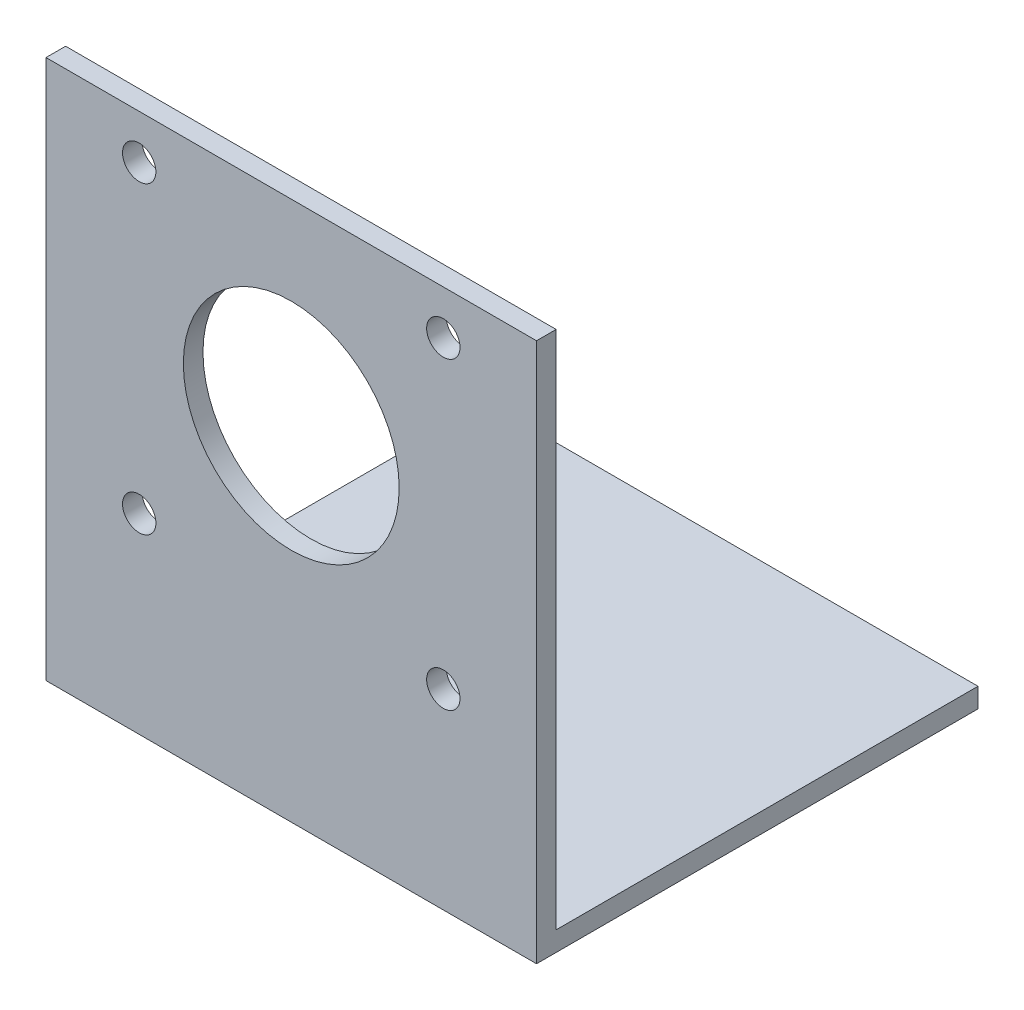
from build123d import *

# Parameters (mm, degrees)
SKETCH1_W               = 50
SKETCH1_H               = 55
BOSS_EXTRUDE1_DEPTH     = 2
SKETCH2_W               = 50
SKETCH2_H               = 2
BOSS_EXTRUDE2_DEPTH     = 45
CUT_EXTRUDE1_DEPTH      = 76.332595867
CUT_EXTRUDE1_DEPTH_BACK = 76.332595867
SKETCH3_R               = 1.7
LO_TAM_D22_DEPTH        = 76.332595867
LO_TAM_D22_DEPTH_BACK   = 76.332595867
SKETCH4_R               = 11


with BuildPart() as part:
    # Sketch1 → Boss-Extrude1 (new body)
    with BuildSketch(Plane.XY):
        with Locations((0, 27.5)):
            Rectangle(SKETCH1_W, SKETCH1_H)
    extrude(amount=-BOSS_EXTRUDE1_DEPTH)

    # Sketch2 → Boss-Extrude2 (add)
    with BuildSketch(Plane.XY):
        with Locations((0, 1)):
            Rectangle(SKETCH2_W, SKETCH2_H)
    extrude(amount=-BOSS_EXTRUDE2_DEPTH)

    # Sketch3 → Cut-Extrude1 (cut, two sides: drawn at the far end of the back side and taken through both)
    with BuildSketch(Plane.XY.offset(-CUT_EXTRUDE1_DEPTH_BACK)):
        with Locations(Location((-15.5, 19.5, 0), (0, 0, 180))):
            Circle(SKETCH3_R)
        with Locations(Location((-15.5, 50.5, 0), (0, 0, 180))):
            Circle(SKETCH3_R)
        with Locations(Location((15.5, 19.5, 0), (0, 0, 180))):
            Circle(SKETCH3_R)
        with Locations(Location((15.5, 50.5, 0), (0, 0, 180))):
            Circle(SKETCH3_R)
    extrude(amount=CUT_EXTRUDE1_DEPTH + CUT_EXTRUDE1_DEPTH_BACK, mode=Mode.SUBTRACT)

    # Sketch4 → Lo_tam_D22 (cut, two sides: drawn at the far end of the back side and taken through both)
    with BuildSketch(Plane.XY.offset(-LO_TAM_D22_DEPTH_BACK)):
        with Locations(Location((0, 35, 0), (0, 0, 180))):
            Circle(SKETCH4_R)
    extrude(amount=LO_TAM_D22_DEPTH + LO_TAM_D22_DEPTH_BACK, mode=Mode.SUBTRACT)


solid = part.part
